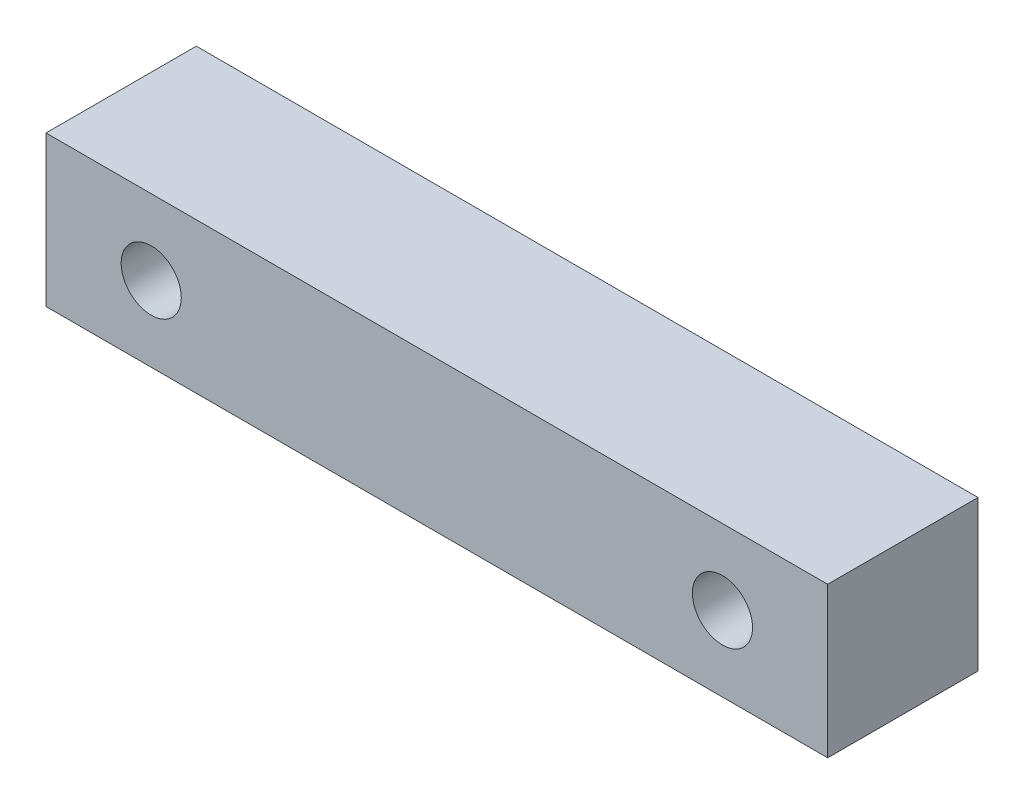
from build123d import *

# Parameters (mm, degrees)
SKETCH1_W           = 26
SKETCH1_H           = 5
BOSS_EXTRUDE1_DEPTH = 5
SKETCH2_R           = 1
CUT_EXTRUDE1_DEPTH  = 5


with BuildPart() as part:
    # Sketch1 → Boss-Extrude1 (new body)
    with BuildSketch(Plane.XY):
        Rectangle(SKETCH1_W, SKETCH1_H)
    extrude(amount=BOSS_EXTRUDE1_DEPTH)

    # Sketch2 → Cut-Extrude1 (cut)
    with BuildSketch(Plane.XY.offset(5)):
        with Locations((-9.5, 0)):
            Circle(SKETCH2_R)
        with Locations((9.5, 0)):
            Circle(SKETCH2_R)
    extrude(amount=-CUT_EXTRUDE1_DEPTH, mode=Mode.SUBTRACT)


solid = part.part
